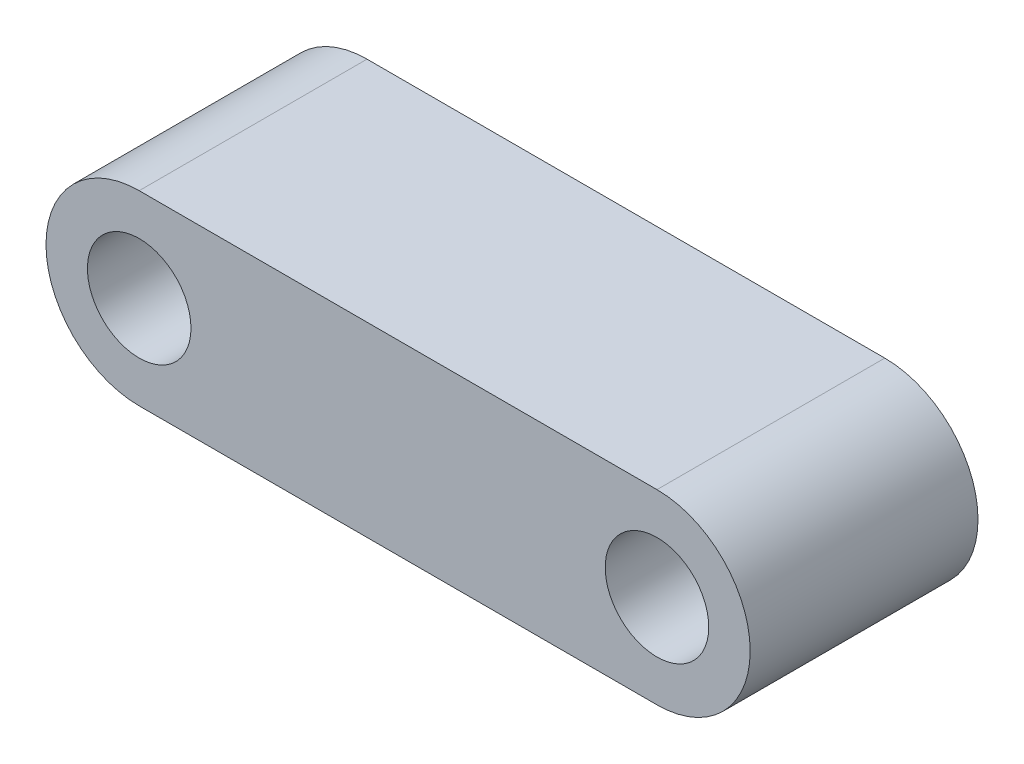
ISO-10303-21;
HEADER;
FILE_DESCRIPTION(('STEP AP214'),'2;1');
FILE_NAME('part.step','',(''),(''),'','','');
FILE_SCHEMA(('AUTOMOTIVE_DESIGN { 1 0 10303 214 1 1 1 1 }'));
ENDSEC;
DATA;
#1=APPLICATION_CONTEXT('core data for automotive mechanical design processes');
#2=APPLICATION_PROTOCOL_DEFINITION('international standard','automotive_design',2000,#1);
#3=PRODUCT_CONTEXT('',#1,'mechanical');
#4=PRODUCT('Part','Part','',(#3));
#5=PRODUCT_RELATED_PRODUCT_CATEGORY('part','',(#4));
#6=PRODUCT_DEFINITION_FORMATION('','',#4);
#7=PRODUCT_DEFINITION_CONTEXT('part definition',#1,'design');
#8=PRODUCT_DEFINITION('design','',#6,#7);
#9=PRODUCT_DEFINITION_SHAPE('','',#8);
#10=(LENGTH_UNIT() NAMED_UNIT(*) SI_UNIT(.MILLI.,.METRE.));
#11=(NAMED_UNIT(*) PLANE_ANGLE_UNIT() SI_UNIT($,.RADIAN.));
#12=(NAMED_UNIT(*) SI_UNIT($,.STERADIAN.) SOLID_ANGLE_UNIT());
#13=UNCERTAINTY_MEASURE_WITH_UNIT(LENGTH_MEASURE(1.E-05),#10,'distance_accuracy_value','');
#14=(GEOMETRIC_REPRESENTATION_CONTEXT(3) GLOBAL_UNCERTAINTY_ASSIGNED_CONTEXT((#13)) GLOBAL_UNIT_ASSIGNED_CONTEXT((#10,
#11,#12)) REPRESENTATION_CONTEXT('',''));
#15=CARTESIAN_POINT('',(0.,0.,0.));
#16=DIRECTION('',(0.,0.,1.));
#17=DIRECTION('',(1.,0.,0.));
#18=AXIS2_PLACEMENT_3D('',#15,#16,#17);
#19=CARTESIAN_POINT('',(-12.5,0.,11.));
#20=DIRECTION('',(0.,0.,-1.));
#21=DIRECTION('',(-1.,0.,0.));
#22=AXIS2_PLACEMENT_3D('',#19,#20,#21);
#23=CYLINDRICAL_SURFACE('',#22,4.5);
#24=CARTESIAN_POINT('',(-12.5,0.,0.));
#25=DIRECTION('',(0.,0.,1.));
#26=DIRECTION('',(1.,0.,0.));
#27=AXIS2_PLACEMENT_3D('',#24,#25,#26);
#28=CIRCLE('',#27,4.5);
#29=CARTESIAN_POINT('',(-12.5,4.5,0.));
#30=VERTEX_POINT('',#29);
#31=CARTESIAN_POINT('',(-12.5,-4.5,0.));
#32=VERTEX_POINT('',#31);
#33=EDGE_CURVE('E98',#30,#32,#28,.T.);
#34=ORIENTED_EDGE('',*,*,#33,.T.);
#35=DIRECTION('',(0.,0.,-1.));
#36=VECTOR('',#35,1.);
#37=CARTESIAN_POINT('',(-12.5,-4.5,11.));
#38=LINE('',#37,#36);
#39=CARTESIAN_POINT('',(-12.5,-4.5,11.));
#40=VERTEX_POINT('',#39);
#41=EDGE_CURVE('E11',#40,#32,#38,.T.);
#42=ORIENTED_EDGE('',*,*,#41,.F.);
#43=CARTESIAN_POINT('',(-12.5,0.,11.));
#44=DIRECTION('',(0.,0.,1.));
#45=DIRECTION('',(1.,0.,0.));
#46=AXIS2_PLACEMENT_3D('',#43,#44,#45);
#47=CIRCLE('',#46,4.5);
#48=CARTESIAN_POINT('',(-12.5,4.5,11.));
#49=VERTEX_POINT('',#48);
#50=EDGE_CURVE('E86',#49,#40,#47,.T.);
#51=ORIENTED_EDGE('',*,*,#50,.F.);
#52=DIRECTION('',(0.,0.,-1.));
#53=VECTOR('',#52,1.);
#54=CARTESIAN_POINT('',(-12.5,4.5,11.));
#55=LINE('',#54,#53);
#56=EDGE_CURVE('E94',#49,#30,#55,.T.);
#57=ORIENTED_EDGE('',*,*,#56,.T.);
#58=EDGE_LOOP('',(#34,#42,#51,#57));
#59=FACE_BOUND('',#58,.T.);
#60=ADVANCED_FACE('F35',(#59),#23,.T.);
#61=CARTESIAN_POINT('',(-12.5,-4.5,11.));
#62=DIRECTION('',(0.,1.,0.));
#63=DIRECTION('',(-1.,0.,0.));
#64=AXIS2_PLACEMENT_3D('',#61,#62,#63);
#65=PLANE('',#64);
#66=DIRECTION('',(1.,0.,0.));
#67=VECTOR('',#66,1.);
#68=CARTESIAN_POINT('',(-12.5,-4.5,0.));
#69=LINE('',#68,#67);
#70=CARTESIAN_POINT('',(12.5,-4.5,0.));
#71=VERTEX_POINT('',#70);
#72=EDGE_CURVE('E90',#32,#71,#69,.T.);
#73=ORIENTED_EDGE('',*,*,#72,.T.);
#74=DIRECTION('',(0.,0.,-1.));
#75=VECTOR('',#74,1.);
#76=CARTESIAN_POINT('',(12.5,-4.5,11.));
#77=LINE('',#76,#75);
#78=CARTESIAN_POINT('',(12.5,-4.5,11.));
#79=VERTEX_POINT('',#78);
#80=EDGE_CURVE('E43',#79,#71,#77,.T.);
#81=ORIENTED_EDGE('',*,*,#80,.F.);
#82=DIRECTION('',(1.,0.,0.));
#83=VECTOR('',#82,1.);
#84=CARTESIAN_POINT('',(-12.5,-4.5,11.));
#85=LINE('',#84,#83);
#86=EDGE_CURVE('E81',#40,#79,#85,.T.);
#87=ORIENTED_EDGE('',*,*,#86,.F.);
#88=ORIENTED_EDGE('',*,*,#41,.T.);
#89=EDGE_LOOP('',(#73,#81,#87,#88));
#90=FACE_BOUND('',#89,.T.);
#91=ADVANCED_FACE('F89',(#90),#65,.F.);
#92=CARTESIAN_POINT('',(12.5,0.,11.));
#93=DIRECTION('',(0.,0.,-1.));
#94=DIRECTION('',(-1.,0.,0.));
#95=AXIS2_PLACEMENT_3D('',#92,#93,#94);
#96=CYLINDRICAL_SURFACE('',#95,4.5);
#97=CARTESIAN_POINT('',(12.5,0.,0.));
#98=DIRECTION('',(0.,0.,1.));
#99=DIRECTION('',(1.,0.,0.));
#100=AXIS2_PLACEMENT_3D('',#97,#98,#99);
#101=CIRCLE('',#100,4.5);
#102=CARTESIAN_POINT('',(12.5,4.5,0.));
#103=VERTEX_POINT('',#102);
#104=EDGE_CURVE('E68',#71,#103,#101,.T.);
#105=ORIENTED_EDGE('',*,*,#104,.T.);
#106=DIRECTION('',(0.,0.,-1.));
#107=VECTOR('',#106,1.);
#108=CARTESIAN_POINT('',(12.5,4.5,11.));
#109=LINE('',#108,#107);
#110=CARTESIAN_POINT('',(12.5,4.5,11.));
#111=VERTEX_POINT('',#110);
#112=EDGE_CURVE('E91',#111,#103,#109,.T.);
#113=ORIENTED_EDGE('',*,*,#112,.F.);
#114=CARTESIAN_POINT('',(12.5,0.,11.));
#115=DIRECTION('',(0.,0.,1.));
#116=DIRECTION('',(1.,0.,0.));
#117=AXIS2_PLACEMENT_3D('',#114,#115,#116);
#118=CIRCLE('',#117,4.5);
#119=EDGE_CURVE('E84',#79,#111,#118,.T.);
#120=ORIENTED_EDGE('',*,*,#119,.F.);
#121=ORIENTED_EDGE('',*,*,#80,.T.);
#122=EDGE_LOOP('',(#105,#113,#120,#121));
#123=FACE_BOUND('',#122,.T.);
#124=ADVANCED_FACE('F92',(#123),#96,.T.);
#125=CARTESIAN_POINT('',(-12.5,4.5,11.));
#126=DIRECTION('',(0.,-1.,0.));
#127=DIRECTION('',(1.,0.,0.));
#128=AXIS2_PLACEMENT_3D('',#125,#126,#127);
#129=PLANE('',#128);
#130=DIRECTION('',(-1.,0.,0.));
#131=VECTOR('',#130,1.);
#132=CARTESIAN_POINT('',(-12.5,4.5,0.));
#133=LINE('',#132,#131);
#134=EDGE_CURVE('E74',#103,#30,#133,.T.);
#135=ORIENTED_EDGE('',*,*,#134,.T.);
#136=ORIENTED_EDGE('',*,*,#56,.F.);
#137=DIRECTION('',(-1.,0.,0.));
#138=VECTOR('',#137,1.);
#139=CARTESIAN_POINT('',(-12.5,4.5,11.));
#140=LINE('',#139,#138);
#141=EDGE_CURVE('E51',#111,#49,#140,.T.);
#142=ORIENTED_EDGE('',*,*,#141,.F.);
#143=ORIENTED_EDGE('',*,*,#112,.T.);
#144=EDGE_LOOP('',(#135,#136,#142,#143));
#145=FACE_BOUND('',#144,.T.);
#146=ADVANCED_FACE('F106',(#145),#129,.F.);
#147=CARTESIAN_POINT('',(-12.5,0.,11.));
#148=DIRECTION('',(0.,0.,1.));
#149=DIRECTION('',(1.,0.,0.));
#150=AXIS2_PLACEMENT_3D('',#147,#148,#149);
#151=PLANE('',#150);
#152=CARTESIAN_POINT('',(-12.5,0.,11.));
#153=DIRECTION('',(0.,0.,1.));
#154=DIRECTION('',(1.,0.,0.));
#155=AXIS2_PLACEMENT_3D('',#152,#153,#154);
#156=CIRCLE('',#155,2.5);
#157=CARTESIAN_POINT('',(-10.,0.,11.));
#158=VERTEX_POINT('',#157);
#159=EDGE_CURVE('E118',#158,#158,#156,.T.);
#160=ORIENTED_EDGE('',*,*,#159,.F.);
#161=EDGE_LOOP('',(#160));
#162=FACE_BOUND('',#161,.T.);
#163=CARTESIAN_POINT('',(12.5,0.,11.));
#164=DIRECTION('',(0.,0.,1.));
#165=DIRECTION('',(1.,0.,0.));
#166=AXIS2_PLACEMENT_3D('',#163,#164,#165);
#167=CIRCLE('',#166,2.5);
#168=CARTESIAN_POINT('',(15.,0.,11.));
#169=VERTEX_POINT('',#168);
#170=EDGE_CURVE('E112',#169,#169,#167,.T.);
#171=ORIENTED_EDGE('',*,*,#170,.F.);
#172=EDGE_LOOP('',(#171));
#173=FACE_BOUND('',#172,.T.);
#174=ORIENTED_EDGE('',*,*,#50,.T.);
#175=ORIENTED_EDGE('',*,*,#86,.T.);
#176=ORIENTED_EDGE('',*,*,#119,.T.);
#177=ORIENTED_EDGE('',*,*,#141,.T.);
#178=EDGE_LOOP('',(#174,#175,#176,#177));
#179=FACE_BOUND('',#178,.T.);
#180=ADVANCED_FACE('F82',(#162,#173,#179),#151,.T.);
#181=CARTESIAN_POINT('',(-12.5,0.,0.));
#182=DIRECTION('',(0.,0.,1.));
#183=DIRECTION('',(1.,0.,0.));
#184=AXIS2_PLACEMENT_3D('',#181,#182,#183);
#185=PLANE('',#184);
#186=CARTESIAN_POINT('',(-12.5,0.,0.));
#187=DIRECTION('',(0.,0.,1.));
#188=DIRECTION('',(1.,0.,0.));
#189=AXIS2_PLACEMENT_3D('',#186,#187,#188);
#190=CIRCLE('',#189,2.5);
#191=CARTESIAN_POINT('',(-10.,0.,0.));
#192=VERTEX_POINT('',#191);
#193=EDGE_CURVE('E101',#192,#192,#190,.T.);
#194=ORIENTED_EDGE('',*,*,#193,.T.);
#195=EDGE_LOOP('',(#194));
#196=FACE_BOUND('',#195,.T.);
#197=CARTESIAN_POINT('',(12.5,0.,0.));
#198=DIRECTION('',(0.,0.,1.));
#199=DIRECTION('',(1.,0.,0.));
#200=AXIS2_PLACEMENT_3D('',#197,#198,#199);
#201=CIRCLE('',#200,2.5);
#202=CARTESIAN_POINT('',(15.,0.,0.));
#203=VERTEX_POINT('',#202);
#204=EDGE_CURVE('E115',#203,#203,#201,.T.);
#205=ORIENTED_EDGE('',*,*,#204,.T.);
#206=EDGE_LOOP('',(#205));
#207=FACE_BOUND('',#206,.T.);
#208=ORIENTED_EDGE('',*,*,#33,.F.);
#209=ORIENTED_EDGE('',*,*,#134,.F.);
#210=ORIENTED_EDGE('',*,*,#104,.F.);
#211=ORIENTED_EDGE('',*,*,#72,.F.);
#212=EDGE_LOOP('',(#208,#209,#210,#211));
#213=FACE_BOUND('',#212,.T.);
#214=ADVANCED_FACE('F109',(#196,#207,#213),#185,.F.);
#215=CARTESIAN_POINT('',(12.5,0.,0.));
#216=DIRECTION('',(0.,0.,1.));
#217=DIRECTION('',(1.,0.,0.));
#218=AXIS2_PLACEMENT_3D('',#215,#216,#217);
#219=CYLINDRICAL_SURFACE('',#218,2.5);
#220=ORIENTED_EDGE('',*,*,#204,.F.);
#221=EDGE_LOOP('',(#220));
#222=FACE_BOUND('',#221,.T.);
#223=ORIENTED_EDGE('',*,*,#170,.T.);
#224=EDGE_LOOP('',(#223));
#225=FACE_BOUND('',#224,.T.);
#226=ADVANCED_FACE('F129',(#222,#225),#219,.F.);
#227=CARTESIAN_POINT('',(-12.5,0.,0.));
#228=DIRECTION('',(0.,0.,1.));
#229=DIRECTION('',(1.,0.,0.));
#230=AXIS2_PLACEMENT_3D('',#227,#228,#229);
#231=CYLINDRICAL_SURFACE('',#230,2.5);
#232=ORIENTED_EDGE('',*,*,#193,.F.);
#233=EDGE_LOOP('',(#232));
#234=FACE_BOUND('',#233,.T.);
#235=ORIENTED_EDGE('',*,*,#159,.T.);
#236=EDGE_LOOP('',(#235));
#237=FACE_BOUND('',#236,.T.);
#238=ADVANCED_FACE('F126',(#234,#237),#231,.F.);
#239=CLOSED_SHELL('',(#60,#91,#124,#146,#180,#214,#226,#238));
#240=MANIFOLD_SOLID_BREP('B2',#239);
#241=ADVANCED_BREP_SHAPE_REPRESENTATION('',(#18,#240),#14);
#242=SHAPE_DEFINITION_REPRESENTATION(#9,#241);
ENDSEC;
END-ISO-10303-21;
